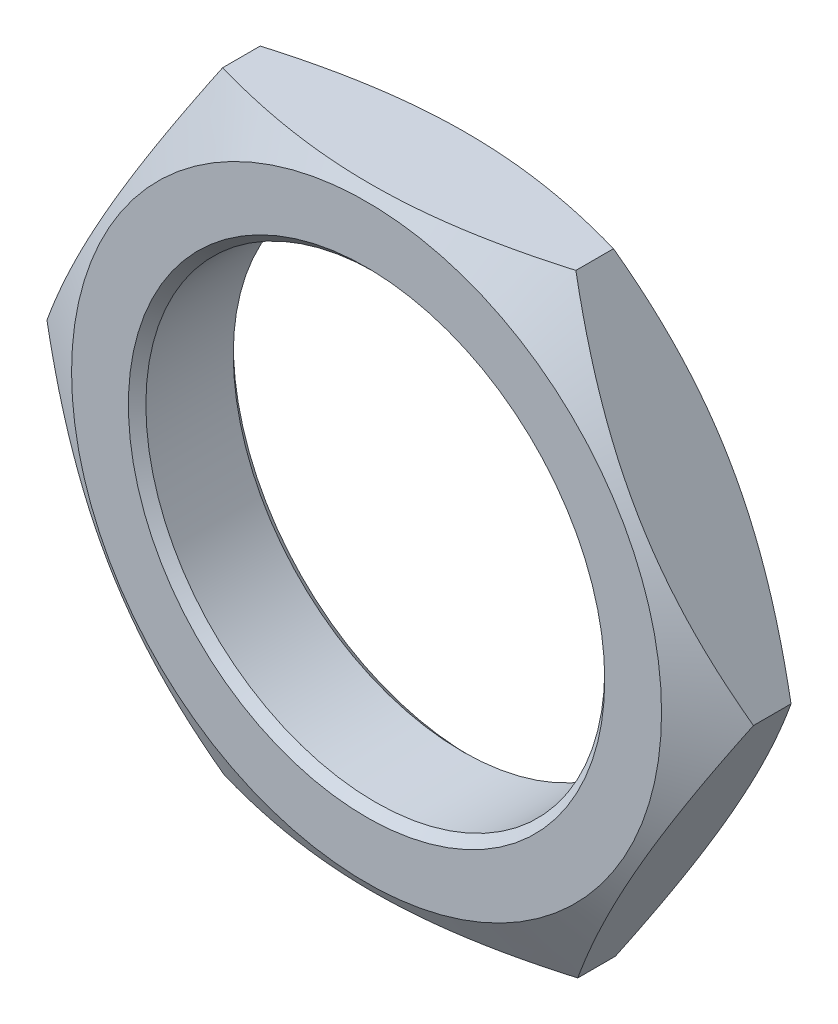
from build123d import *

# Parameters (mm, degrees)
ESQUISSE1_R             = 5.25
BOSS_EXTRU_1_DEPTH      = 2.4
ESQUISSE2_OUTSIDE_W     = 25.938
ESQUISSE2_OUTSIDE_H     = 23.798
ESQUISSE2_OUTSIDE_R     = 6.75
ENL_V_MAT_EXTRU_3_DEPTH = 1
ENL_V_MAT_EXTRU_3_DRAFT = -60
ESQUISSE3_OUTSIDE_W     = 25.938
ESQUISSE3_OUTSIDE_H     = 23.798
ESQUISSE3_OUTSIDE_R     = 6.75
ENL_V_MAT_EXTRU_4_DEPTH = 1
ENL_V_MAT_EXTRU_4_DRAFT = -60
CHANFREIN2_SIZE         = 0.2


with BuildPart() as part:
    # Esquisse1 → Boss.-Extru.1 (new body)
    with BuildSketch(Plane.XY):
        Polygon((4.063155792, -6.9874243), (8.082864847, 0.025083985), (4.019709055, 7.012508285), (-4.063155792, 6.9874243), (-8.082864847, -0.025083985), (-4.019709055, -7.012508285), align=None)
        Circle(ESQUISSE1_R, mode=Mode.SUBTRACT)
    extrude(amount=BOSS_EXTRU_1_DEPTH)


with BuildPart() as enl_v_mat_extru_3_tool:
    # Esquisse2 outside → Enl_v. mat.-Extru.3 (with draft: the straight prism first)
    with BuildSketch(Plane.XY.offset(2.4)):
        Rectangle(ESQUISSE2_OUTSIDE_W, ESQUISSE2_OUTSIDE_H)
        Circle(ESQUISSE2_OUTSIDE_R, mode=Mode.SUBTRACT)
    extrude(amount=-ENL_V_MAT_EXTRU_3_DEPTH)
    # Enl_v. mat.-Extru.3: the draft: its side faces are tilted about the plane it starts from
    enl_v_mat_extru_3_sides = [enl_v_mat_extru_3_tool.faces().sort_by_distance(p)[0] for p in [
        (0, -11.899, 1.9),
        (12.969, 0, 1.9),
        (0, 11.899, 1.9),
        (-12.969, 0, 1.9),
        (-6.75, 0, 1.9),
    ]]
    draft(enl_v_mat_extru_3_sides, Plane.XY.offset(2.4), ENL_V_MAT_EXTRU_3_DRAFT)


with BuildPart() as part_1:
    add(part.part)

    # Enl_v. mat.-Extru.3: cut by enl_v_mat_extru_3_tool
    add(enl_v_mat_extru_3_tool.part, mode=Mode.SUBTRACT)


with BuildPart() as enl_v_mat_extru_4_tool:
    # Esquisse3 outside → Enl_v. mat.-Extru.4 (with draft: the straight prism first)
    with BuildSketch(Plane(origin=(0, 0, 0), x_dir=(-1, 0, 0), z_dir=(0, 0, -1))):
        Rectangle(ESQUISSE3_OUTSIDE_W, ESQUISSE3_OUTSIDE_H)
        Circle(ESQUISSE3_OUTSIDE_R, mode=Mode.SUBTRACT)
    extrude(amount=-ENL_V_MAT_EXTRU_4_DEPTH)
    # Enl_v. mat.-Extru.4: the draft: its side faces are tilted about the plane it starts from
    enl_v_mat_extru_4_sides = [enl_v_mat_extru_4_tool.faces().sort_by_distance(p)[0] for p in [
        (0, -11.899, 0.5),
        (-12.969, 0, 0.5),
        (0, 11.899, 0.5),
        (12.969, 0, 0.5),
        (6.75, 0, 0.5),
    ]]
    draft(enl_v_mat_extru_4_sides, Plane(origin=(0, 0, 0), x_dir=(-1, 0, 0), z_dir=(0, 0, -1)), ENL_V_MAT_EXTRU_4_DRAFT)


with BuildPart() as part_2:
    add(part_1.part)

    # Enl_v. mat.-Extru.4: cut by enl_v_mat_extru_4_tool
    add(enl_v_mat_extru_4_tool.part, mode=Mode.SUBTRACT)

    # Chanfrein2
    chanfrein2_edges = [part_2.edges().sort_by_distance(p)[0] for p in [
        (-5.25, 0, 0),
        (-5.25, 0, 2.4),
    ]]
    chamfer(chanfrein2_edges, length=CHANFREIN2_SIZE)


solid = part_2.part
